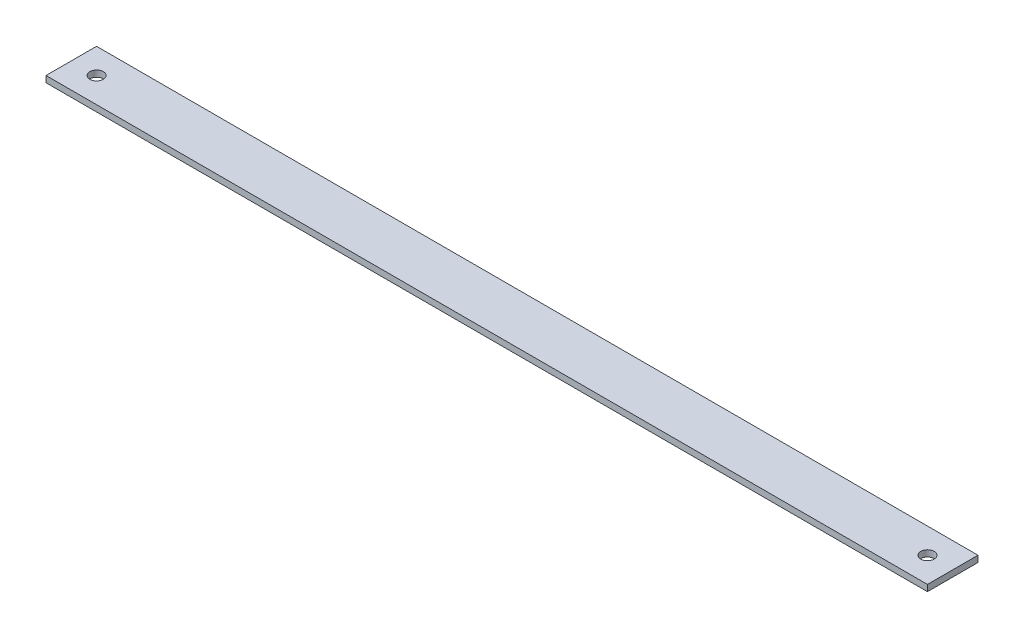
from build123d import *

# Parameters (mm, degrees)
SKETCH1_W           = 442.976
SKETCH1_H           = 25.4
BOSS_EXTRUDE1_DEPTH = 3.175
SKETCH3_R           = 3.3782
CUT_EXTRUDE1_DEPTH  = 222.874524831


with BuildPart() as part:
    # Sketch1 → Boss-Extrude1 (new body)
    with BuildSketch(Plane(origin=(0, 0, 0), x_dir=(1, 0, 0), z_dir=(0, 1, 0))):
        Rectangle(SKETCH1_W, SKETCH1_H)
    extrude(amount=BOSS_EXTRUDE1_DEPTH)

    # Sketch3 → Cut-Extrude1 (cut, through all)
    with BuildSketch(Plane(origin=(0, 3.175, 0), x_dir=(1, 0, 0), z_dir=(0, 1, 0))):
        with Locations(Location((-208.788, 0, 0), (0, 0, 270))):
            Circle(SKETCH3_R)
        with Locations(Location((208.788, 0, 0), (0, 0, 270))):
            Circle(SKETCH3_R)
    extrude(amount=-CUT_EXTRUDE1_DEPTH, mode=Mode.SUBTRACT)


solid = part.part
